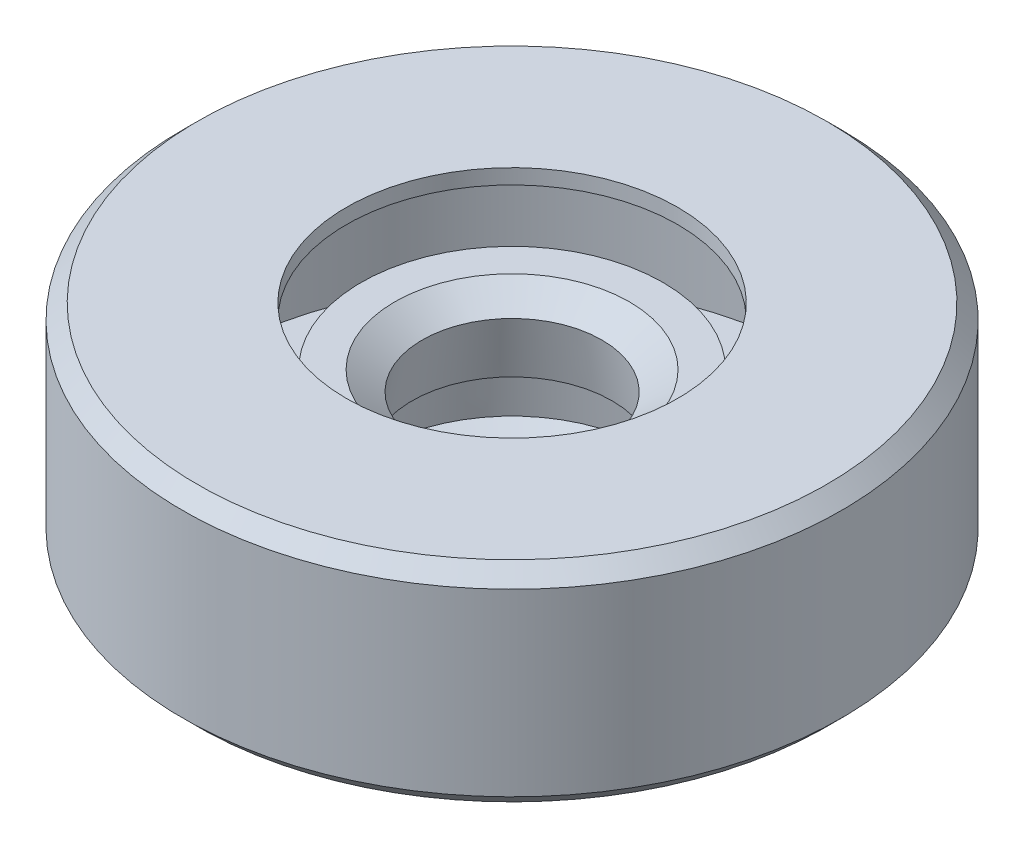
from build123d import *


with BuildPart() as part:
    # Sketch 1 → Revolve 1 (revolve)
    with BuildSketch(Plane.XY, mode=Mode.PRIVATE) as revolve_1_sk:
        with BuildLine():
            Line((-4.838882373, 3.10342775), (-5.028769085, 0.933012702))
            Line((-5.028769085, 0.933012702), (-5.528769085, 0.933012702))
            Line((-5.528769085, 0.933012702), (-5.778769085, 0.5))
            Line((-5.778769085, 0.5), (-10, 0.5))
            Line((-10, 0.5), (-10, 6.5))
            Line((-10, 6.5), (-5.528769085, 6.5))
            Line((-5.528769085, 6.5), (-5.528769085, 7))
            Line((-5.528769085, 7), (-10.5, 7))
            Line((-10.5, 7), (-11, 6.5))
            Line((-11, 6.5), (-11, 0.5))
            Line((-11, 0.5), (-10.5, 0))
            Line((-10.5, 0), (-5.0084872, 0))
            ThreePointArc((-5.0084872, 0), (-4.6084872, 0.3), (-4.2084872, 0))
            Line((-4.2084872, 0), (-3.340059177, 0.075977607))
            Line((-3.340059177, 0.075977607), (-4.564742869, 0.5))
            Line((-4.564742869, 0.5), (-4.389765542, 2.5))
            Line((-4.389765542, 2.5), (-3.340059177, 2.5))
            Line((-3.340059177, 2.5), (-3, 4.428571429))
            Line((-3, 4.428571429), (-3.918095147, 5.071428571))
            Line((-3.918095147, 5.071428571), (-5.038882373, 5.071428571))
            Line((-5.038882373, 5.071428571), (-5.038882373, 3.950641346))
            ThreePointArc((-5.038882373, 3.950641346), (-5.274132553, 3.447892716), (-4.838882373, 3.10342775))
        make_face()
    revolve(revolve_1_sk.sketch.rotate(Axis((0, 0, 0), (0, 1, 0)), 270), axis=Axis((0, 0, 0), (0, 1, 0)))


solid = part.part
